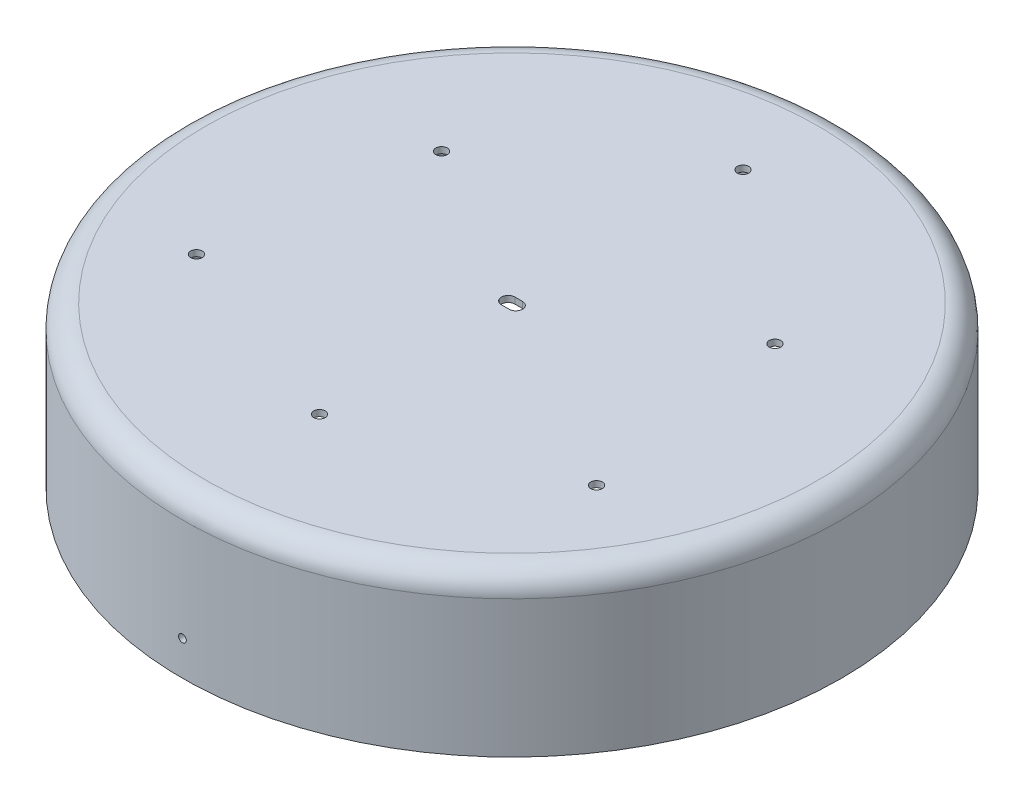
from build123d import *

# Parameters (mm, degrees)
SKETCH_2_R               = 1.5
CUT_EXTRUDE_1_DEPTH      = 10
CUT_EXTRUDE_2_DEPTH      = 129.004999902
CUT_EXTRUDE_2_DEPTH_BACK = 129.004999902
SKETCH_4_R               = 1


with BuildPart() as part:
    # Sketch 1 → Revolve 1 (revolve)
    with BuildSketch(Plane.XY):
        with BuildLine():
            Line((0, 41.6), (-79.6, 41.6))
            ThreePointArc((-79.6, 41.6), (-83.842640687, 39.842640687), (-85.6, 35.6))
            Line((-85.6, 35.6), (-85.6, 0))
            Line((-85.6, 0), (-84, 0))
            Line((-84, 0), (-84, 36))
            ThreePointArc((-84, 36), (-82.828427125, 38.828427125), (-80, 40))
            Line((-80, 40), (0, 40))
            Line((0, 40), (0, 41.6))
        make_face()
    revolve(axis=Axis((0, 50.600945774, 0), (0, -1, 0)))

    # Sketch 2 → Cut-Extrude 1 (cut)
    with BuildSketch(Plane(origin=(0, 41.6, 0), x_dir=(1, 0, 0), z_dir=(0, 1, 0))):
        with Locations(Location((0, 60, 0), (0, 0, 180))):
            Circle(SKETCH_2_R)
        with Locations(Location((51.961524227, -30, 0), (0, 0, 180))):
            Circle(SKETCH_2_R)
        with Locations(Location((-51.961524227, -30, 0), (0, 0, 180))):
            Circle(SKETCH_2_R)
        with Locations(Location((43.301270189, 25, 0), (0, 0, 180))):
            Circle(SKETCH_2_R)
        with Locations(Location((0, -50, 0), (0, 0, 180))):
            Circle(SKETCH_2_R)
        with Locations(Location((-43.301270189, 25, 0), (0, 0, 180))):
            Circle(SKETCH_2_R)
        with BuildLine():
            Line((-1, 1.75), (1, 1.75))
            ThreePointArc((1, 1.75), (2.75, 0), (1, -1.75))
            Line((1, -1.75), (-1, -1.75))
            ThreePointArc((-1, -1.75), (-2.75, 0), (-1, 1.75))
        make_face()
    extrude(amount=-CUT_EXTRUDE_1_DEPTH, mode=Mode.SUBTRACT)

    # Sketch 4 → Cut-Extrude 2 (cut, two sides: drawn at the far end of the back side and taken through both)
    with BuildSketch(Plane.XY.offset(-CUT_EXTRUDE_2_DEPTH_BACK)):
        with Locations((0, 9)):
            Circle(SKETCH_4_R)
    extrude(amount=CUT_EXTRUDE_2_DEPTH + CUT_EXTRUDE_2_DEPTH_BACK, mode=Mode.SUBTRACT)


solid = part.part
